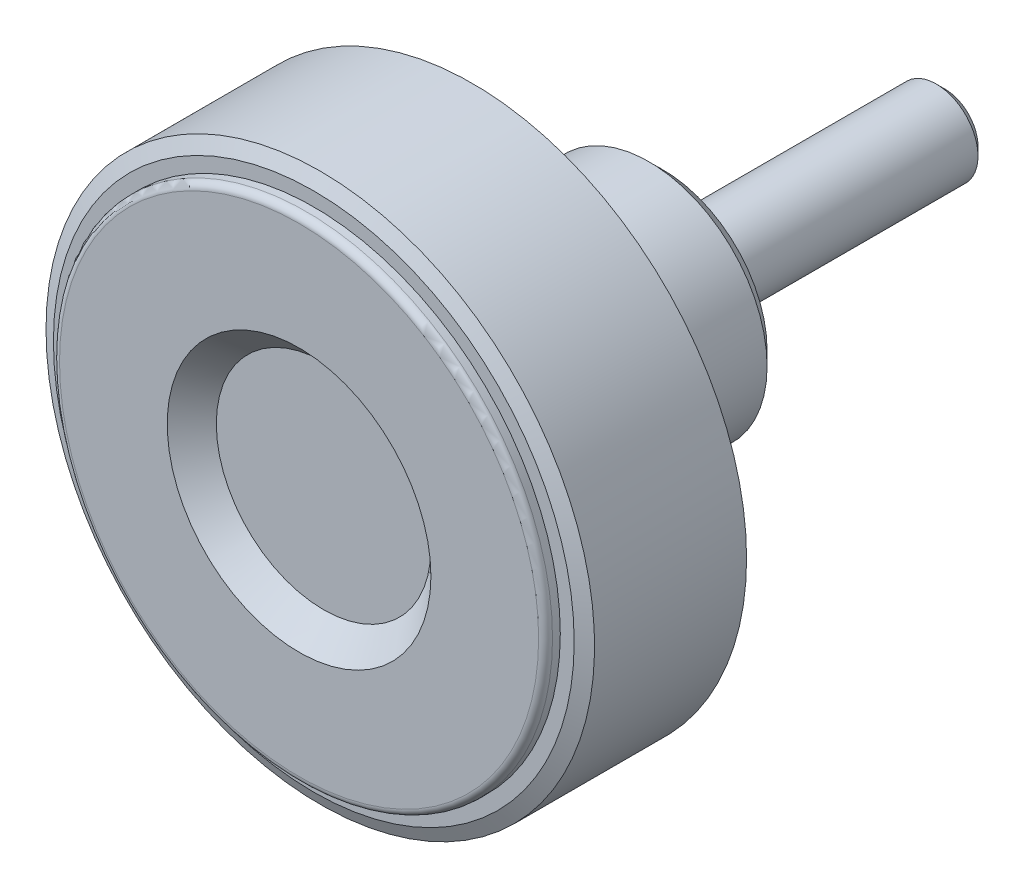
ISO-10303-21;
HEADER;
FILE_DESCRIPTION(('STEP AP214'),'2;1');
FILE_NAME('part.step','',(''),(''),'','','');
FILE_SCHEMA(('AUTOMOTIVE_DESIGN { 1 0 10303 214 1 1 1 1 }'));
ENDSEC;
DATA;
#1=APPLICATION_CONTEXT('core data for automotive mechanical design processes');
#2=APPLICATION_PROTOCOL_DEFINITION('international standard','automotive_design',2000,#1);
#3=PRODUCT_CONTEXT('',#1,'mechanical');
#4=PRODUCT('Part','Part','',(#3));
#5=PRODUCT_RELATED_PRODUCT_CATEGORY('part','',(#4));
#6=PRODUCT_DEFINITION_FORMATION('','',#4);
#7=PRODUCT_DEFINITION_CONTEXT('part definition',#1,'design');
#8=PRODUCT_DEFINITION('design','',#6,#7);
#9=PRODUCT_DEFINITION_SHAPE('','',#8);
#10=(LENGTH_UNIT() NAMED_UNIT(*) SI_UNIT(.MILLI.,.METRE.));
#11=(NAMED_UNIT(*) PLANE_ANGLE_UNIT() SI_UNIT($,.RADIAN.));
#12=(NAMED_UNIT(*) SI_UNIT($,.STERADIAN.) SOLID_ANGLE_UNIT());
#13=UNCERTAINTY_MEASURE_WITH_UNIT(LENGTH_MEASURE(1.E-05),#10,'distance_accuracy_value','');
#14=(GEOMETRIC_REPRESENTATION_CONTEXT(3) GLOBAL_UNCERTAINTY_ASSIGNED_CONTEXT((#13)) GLOBAL_UNIT_ASSIGNED_CONTEXT((#10,
#11,#12)) REPRESENTATION_CONTEXT('',''));
#15=CARTESIAN_POINT('',(0.,0.,0.));
#16=DIRECTION('',(0.,0.,1.));
#17=DIRECTION('',(1.,0.,0.));
#18=AXIS2_PLACEMENT_3D('',#15,#16,#17);
#19=CARTESIAN_POINT('',(0.,1.19325,-20.));
#20=DIRECTION('',(0.,0.,-1.));
#21=DIRECTION('',(-1.,0.,0.));
#22=AXIS2_PLACEMENT_3D('',#19,#20,#21);
#23=PLANE('',#22);
#24=CARTESIAN_POINT('',(0.,0.,-19.9999999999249));
#25=DIRECTION('',(0.,0.,1.));
#26=DIRECTION('',(1.,0.,0.));
#27=AXIS2_PLACEMENT_3D('',#24,#25,#26);
#28=CIRCLE('',#27,2.38650000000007);
#29=CARTESIAN_POINT('',(2.38650000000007,0.,-19.9999999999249));
#30=VERTEX_POINT('',#29);
#31=EDGE_CURVE('E179',#30,#30,#28,.T.);
#32=ORIENTED_EDGE('',*,*,#31,.F.);
#33=EDGE_LOOP('',(#32));
#34=FACE_BOUND('',#33,.T.);
#35=ADVANCED_FACE('F14',(#34),#23,.T.);
#36=CARTESIAN_POINT('',(0.,0.,-19.386499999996));
#37=DIRECTION('',(0.,0.,1.));
#38=DIRECTION('',(1.,0.,0.));
#39=AXIS2_PLACEMENT_3D('',#36,#37,#38);
#40=CONICAL_SURFACE('',#39,2.99999999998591,0.785398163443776);
#41=ORIENTED_EDGE('',*,*,#31,.T.);
#42=EDGE_LOOP('',(#41));
#43=FACE_BOUND('',#42,.T.);
#44=CARTESIAN_POINT('',(0.,0.,-19.3865));
#45=DIRECTION('',(0.,0.,1.));
#46=DIRECTION('',(1.,0.,0.));
#47=AXIS2_PLACEMENT_3D('',#44,#45,#46);
#48=CIRCLE('',#47,3.);
#49=CARTESIAN_POINT('',(3.,0.,-19.3865));
#50=VERTEX_POINT('',#49);
#51=EDGE_CURVE('E176',#50,#50,#48,.T.);
#52=ORIENTED_EDGE('',*,*,#51,.F.);
#53=EDGE_LOOP('',(#52));
#54=FACE_BOUND('',#53,.T.);
#55=ADVANCED_FACE('F536',(#43,#54),#40,.T.);
#56=CARTESIAN_POINT('',(0.,0.,-9.19325));
#57=DIRECTION('',(0.,0.,1.));
#58=DIRECTION('',(1.,0.,0.));
#59=AXIS2_PLACEMENT_3D('',#56,#57,#58);
#60=CYLINDRICAL_SURFACE('',#59,3.);
#61=ORIENTED_EDGE('',*,*,#51,.T.);
#62=EDGE_LOOP('',(#61));
#63=FACE_BOUND('',#62,.T.);
#64=CARTESIAN_POINT('',(0.,0.,0.));
#65=DIRECTION('',(0.,0.,1.));
#66=DIRECTION('',(1.,0.,0.));
#67=AXIS2_PLACEMENT_3D('',#64,#65,#66);
#68=CIRCLE('',#67,3.);
#69=CARTESIAN_POINT('',(3.,0.,0.));
#70=VERTEX_POINT('',#69);
#71=EDGE_CURVE('E178',#70,#70,#68,.T.);
#72=ORIENTED_EDGE('',*,*,#71,.F.);
#73=EDGE_LOOP('',(#72));
#74=FACE_BOUND('',#73,.T.);
#75=ADVANCED_FACE('F526',(#63,#74),#60,.T.);
#76=CARTESIAN_POINT('',(0.,2.,0.));
#77=DIRECTION('',(0.,0.,-1.));
#78=DIRECTION('',(-1.,0.,0.));
#79=AXIS2_PLACEMENT_3D('',#76,#77,#78);
#80=PLANE('',#79);
#81=CARTESIAN_POINT('',(0.,0.,0.));
#82=DIRECTION('',(0.,0.,1.));
#83=DIRECTION('',(1.,0.,0.));
#84=AXIS2_PLACEMENT_3D('',#81,#82,#83);
#85=CIRCLE('',#84,4.);
#86=CARTESIAN_POINT('',(4.,0.,0.));
#87=VERTEX_POINT('',#86);
#88=EDGE_CURVE('E211',#87,#87,#85,.T.);
#89=ORIENTED_EDGE('',*,*,#88,.F.);
#90=EDGE_LOOP('',(#89));
#91=FACE_BOUND('',#90,.T.);
#92=ORIENTED_EDGE('',*,*,#71,.T.);
#93=EDGE_LOOP('',(#92));
#94=FACE_BOUND('',#93,.T.);
#95=ADVANCED_FACE('F516',(#91,#94),#80,.T.);
#96=CARTESIAN_POINT('',(0.,0.,0.15));
#97=DIRECTION('',(0.,0.,1.));
#98=DIRECTION('',(1.,0.,0.));
#99=AXIS2_PLACEMENT_3D('',#96,#97,#98);
#100=CYLINDRICAL_SURFACE('',#99,4.);
#101=ORIENTED_EDGE('',*,*,#88,.T.);
#102=EDGE_LOOP('',(#101));
#103=FACE_BOUND('',#102,.T.);
#104=CARTESIAN_POINT('',(0.,0.,0.3));
#105=DIRECTION('',(0.,0.,1.));
#106=DIRECTION('',(1.,0.,0.));
#107=AXIS2_PLACEMENT_3D('',#104,#105,#106);
#108=CIRCLE('',#107,4.);
#109=CARTESIAN_POINT('',(4.,0.,0.3));
#110=VERTEX_POINT('',#109);
#111=EDGE_CURVE('E208',#110,#110,#108,.T.);
#112=ORIENTED_EDGE('',*,*,#111,.F.);
#113=EDGE_LOOP('',(#112));
#114=FACE_BOUND('',#113,.T.);
#115=ADVANCED_FACE('F506',(#103,#114),#100,.T.);
#116=CARTESIAN_POINT('',(0.,5.75,0.3));
#117=DIRECTION('',(0.,0.,-1.));
#118=DIRECTION('',(-1.,0.,0.));
#119=AXIS2_PLACEMENT_3D('',#116,#117,#118);
#120=PLANE('',#119);
#121=CARTESIAN_POINT('',(0.,0.,0.3));
#122=DIRECTION('',(0.,0.,1.));
#123=DIRECTION('',(1.,0.,0.));
#124=AXIS2_PLACEMENT_3D('',#121,#122,#123);
#125=CIRCLE('',#124,7.5);
#126=CARTESIAN_POINT('',(7.5,0.,0.3));
#127=VERTEX_POINT('',#126);
#128=EDGE_CURVE('E175',#127,#127,#125,.T.);
#129=ORIENTED_EDGE('',*,*,#128,.F.);
#130=EDGE_LOOP('',(#129));
#131=FACE_BOUND('',#130,.T.);
#132=ORIENTED_EDGE('',*,*,#111,.T.);
#133=EDGE_LOOP('',(#132));
#134=FACE_BOUND('',#133,.T.);
#135=ADVANCED_FACE('F496',(#131,#134),#120,.T.);
#136=CARTESIAN_POINT('',(0.,0.,1.3));
#137=DIRECTION('',(0.,0.,1.));
#138=DIRECTION('',(1.,0.,0.));
#139=AXIS2_PLACEMENT_3D('',#136,#137,#138);
#140=CONICAL_SURFACE('',#139,8.5,0.785398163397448);
#141=ORIENTED_EDGE('',*,*,#128,.T.);
#142=EDGE_LOOP('',(#141));
#143=FACE_BOUND('',#142,.T.);
#144=CARTESIAN_POINT('',(0.,0.,1.3));
#145=DIRECTION('',(0.,0.,1.));
#146=DIRECTION('',(1.,0.,0.));
#147=AXIS2_PLACEMENT_3D('',#144,#145,#146);
#148=CIRCLE('',#147,8.5);
#149=CARTESIAN_POINT('',(8.5,0.,1.3));
#150=VERTEX_POINT('',#149);
#151=EDGE_CURVE('E172',#150,#150,#148,.T.);
#152=ORIENTED_EDGE('',*,*,#151,.F.);
#153=EDGE_LOOP('',(#152));
#154=FACE_BOUND('',#153,.T.);
#155=ADVANCED_FACE('F487',(#143,#154),#140,.T.);
#156=CARTESIAN_POINT('',(0.,0.,11.1916666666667));
#157=DIRECTION('',(0.,0.,1.));
#158=DIRECTION('',(1.,0.,0.));
#159=AXIS2_PLACEMENT_3D('',#156,#157,#158);
#160=CYLINDRICAL_SURFACE('',#159,8.5);
#161=ORIENTED_EDGE('',*,*,#151,.T.);
#162=EDGE_LOOP('',(#161));
#163=FACE_BOUND('',#162,.T.);
#164=CARTESIAN_POINT('',(0.,0.,21.0833333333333));
#165=DIRECTION('',(0.,0.,-1.));
#166=DIRECTION('',(-1.,0.,0.));
#167=AXIS2_PLACEMENT_3D('',#164,#165,#166);
#168=CIRCLE('',#167,8.5);
#169=CARTESIAN_POINT('',(-8.5,0.,21.0833333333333));
#170=VERTEX_POINT('',#169);
#171=EDGE_CURVE('E75',#170,#170,#168,.T.);
#172=ORIENTED_EDGE('',*,*,#171,.T.);
#173=EDGE_LOOP('',(#172));
#174=FACE_BOUND('',#173,.T.);
#175=ADVANCED_FACE('F482',(#163,#174),#160,.T.);
#176=CARTESIAN_POINT('',(0.,0.,21.0833333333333));
#177=DIRECTION('',(0.,0.,-1.));
#178=DIRECTION('',(-1.,0.,0.));
#179=AXIS2_PLACEMENT_3D('',#176,#177,#178);
#180=TOROIDAL_SURFACE('',#179,9.5,1.);
#181=CARTESIAN_POINT('',(0.,0.,22.0833333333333));
#182=DIRECTION('',(0.,0.,-1.));
#183=DIRECTION('',(1.,0.,0.));
#184=AXIS2_PLACEMENT_3D('',#181,#182,#183);
#185=CIRCLE('',#184,9.5);
#186=CARTESIAN_POINT('',(-9.5,0.,22.0833333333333));
#187=VERTEX_POINT('',#186);
#188=CARTESIAN_POINT('',(9.5,0.,22.0833333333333));
#189=VERTEX_POINT('',#188);
#190=EDGE_CURVE('E68',#187,#189,#185,.F.);
#191=ORIENTED_EDGE('',*,*,#190,.F.);
#192=CARTESIAN_POINT('',(0.,0.,22.0833333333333));
#193=DIRECTION('',(0.,0.,-1.));
#194=DIRECTION('',(-1.,0.,0.));
#195=AXIS2_PLACEMENT_3D('',#192,#193,#194);
#196=CIRCLE('',#195,9.5);
#197=CARTESIAN_POINT('',(0.,9.5,22.0833333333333));
#198=VERTEX_POINT('',#197);
#199=EDGE_CURVE('E71',#198,#187,#196,.F.);
#200=ORIENTED_EDGE('',*,*,#199,.F.);
#201=CARTESIAN_POINT('',(0.,0.,22.0833333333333));
#202=DIRECTION('',(0.,0.,-1.));
#203=DIRECTION('',(0.,1.,0.));
#204=AXIS2_PLACEMENT_3D('',#201,#202,#203);
#205=CIRCLE('',#204,9.5);
#206=EDGE_CURVE('E63',#189,#198,#205,.F.);
#207=ORIENTED_EDGE('',*,*,#206,.F.);
#208=EDGE_LOOP('',(#191,#200,#207));
#209=FACE_BOUND('',#208,.T.);
#210=ORIENTED_EDGE('',*,*,#171,.F.);
#211=EDGE_LOOP('',(#210));
#212=FACE_BOUND('',#211,.T.);
#213=ADVANCED_FACE('F66',(#209,#212),#180,.F.);
#214=CARTESIAN_POINT('',(0.,11.8461538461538,22.0833333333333));
#215=DIRECTION('',(0.,0.,-1.));
#216=DIRECTION('',(-1.,0.,0.));
#217=AXIS2_PLACEMENT_3D('',#214,#215,#216);
#218=PLANE('',#217);
#219=CARTESIAN_POINT('',(0.,0.,22.0833333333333));
#220=DIRECTION('',(0.,0.,1.));
#221=DIRECTION('',(-1.,0.,0.));
#222=AXIS2_PLACEMENT_3D('',#219,#220,#221);
#223=CIRCLE('',#222,14.1923076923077);
#224=CARTESIAN_POINT('',(14.1923076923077,0.,22.0833333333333));
#225=VERTEX_POINT('',#224);
#226=CARTESIAN_POINT('',(-14.1923076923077,0.,22.0833333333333));
#227=VERTEX_POINT('',#226);
#228=EDGE_CURVE('E81',#225,#227,#223,.F.);
#229=ORIENTED_EDGE('',*,*,#228,.T.);
#230=CARTESIAN_POINT('',(0.,0.,22.0833333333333));
#231=DIRECTION('',(0.,0.,1.));
#232=DIRECTION('',(0.,1.,0.));
#233=AXIS2_PLACEMENT_3D('',#230,#231,#232);
#234=CIRCLE('',#233,14.1923076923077);
#235=CARTESIAN_POINT('',(0.,14.1923076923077,22.0833333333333));
#236=VERTEX_POINT('',#235);
#237=EDGE_CURVE('E130',#227,#236,#234,.F.);
#238=ORIENTED_EDGE('',*,*,#237,.T.);
#239=CARTESIAN_POINT('',(0.,0.,22.0833333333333));
#240=DIRECTION('',(0.,0.,1.));
#241=DIRECTION('',(1.,0.,0.));
#242=AXIS2_PLACEMENT_3D('',#239,#240,#241);
#243=CIRCLE('',#242,14.1923076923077);
#244=EDGE_CURVE('E143',#236,#225,#243,.F.);
#245=ORIENTED_EDGE('',*,*,#244,.T.);
#246=EDGE_LOOP('',(#229,#238,#245));
#247=FACE_BOUND('',#246,.T.);
#248=ORIENTED_EDGE('',*,*,#199,.T.);
#249=ORIENTED_EDGE('',*,*,#190,.T.);
#250=ORIENTED_EDGE('',*,*,#206,.T.);
#251=EDGE_LOOP('',(#248,#249,#250));
#252=FACE_BOUND('',#251,.T.);
#253=ADVANCED_FACE('F79',(#247,#252),#218,.T.);
#254=CARTESIAN_POINT('',(0.,0.,21.0833333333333));
#255=DIRECTION('',(0.,0.,-1.));
#256=DIRECTION('',(-1.,0.,0.));
#257=AXIS2_PLACEMENT_3D('',#254,#255,#256);
#258=TOROIDAL_SURFACE('',#257,14.1923076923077,1.);
#259=ORIENTED_EDGE('',*,*,#237,.F.);
#260=ORIENTED_EDGE('',*,*,#228,.F.);
#261=ORIENTED_EDGE('',*,*,#244,.F.);
#262=EDGE_LOOP('',(#259,#260,#261));
#263=FACE_BOUND('',#262,.T.);
#264=CARTESIAN_POINT('',(0.,0.,21.0833333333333));
#265=DIRECTION('',(0.,0.,1.));
#266=DIRECTION('',(1.,0.,0.));
#267=AXIS2_PLACEMENT_3D('',#264,#265,#266);
#268=CIRCLE('',#267,15.1923076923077);
#269=CARTESIAN_POINT('',(15.1923076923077,0.,21.0833333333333));
#270=VERTEX_POINT('',#269);
#271=EDGE_CURVE('E205',#270,#270,#268,.F.);
#272=ORIENTED_EDGE('',*,*,#271,.T.);
#273=EDGE_LOOP('',(#272));
#274=FACE_BOUND('',#273,.T.);
#275=ADVANCED_FACE('F100',(#263,#274),#258,.F.);
#276=CARTESIAN_POINT('',(0.,0.,16.7916666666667));
#277=DIRECTION('',(0.,0.,1.));
#278=DIRECTION('',(1.,0.,0.));
#279=AXIS2_PLACEMENT_3D('',#276,#277,#278);
#280=CYLINDRICAL_SURFACE('',#279,15.1923076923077);
#281=ORIENTED_EDGE('',*,*,#271,.F.);
#282=EDGE_LOOP('',(#281));
#283=FACE_BOUND('',#282,.T.);
#284=CARTESIAN_POINT('',(0.,0.,12.5));
#285=DIRECTION('',(0.,0.,1.));
#286=DIRECTION('',(1.,0.,0.));
#287=AXIS2_PLACEMENT_3D('',#284,#285,#286);
#288=CIRCLE('',#287,15.1923076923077);
#289=CARTESIAN_POINT('',(15.1923076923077,0.,12.5));
#290=VERTEX_POINT('',#289);
#291=EDGE_CURVE('E201',#290,#290,#288,.T.);
#292=ORIENTED_EDGE('',*,*,#291,.F.);
#293=EDGE_LOOP('',(#292));
#294=FACE_BOUND('',#293,.T.);
#295=ADVANCED_FACE('F329',(#283,#294),#280,.F.);
#296=CARTESIAN_POINT('',(0.,16.2211538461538,12.5));
#297=DIRECTION('',(0.,0.,-1.));
#298=DIRECTION('',(-1.,0.,0.));
#299=AXIS2_PLACEMENT_3D('',#296,#297,#298);
#300=PLANE('',#299);
#301=CARTESIAN_POINT('',(0.,0.,12.5));
#302=DIRECTION('',(0.,0.,1.));
#303=DIRECTION('',(-1.,0.,0.));
#304=AXIS2_PLACEMENT_3D('',#301,#302,#303);
#305=CIRCLE('',#304,17.25);
#306=CARTESIAN_POINT('',(-17.25,0.,12.5));
#307=VERTEX_POINT('',#306);
#308=CARTESIAN_POINT('',(17.25,0.,12.5));
#309=VERTEX_POINT('',#308);
#310=EDGE_CURVE('E264',#307,#309,#305,.T.);
#311=ORIENTED_EDGE('',*,*,#310,.F.);
#312=CARTESIAN_POINT('',(0.,0.,12.5));
#313=DIRECTION('',(0.,0.,1.));
#314=DIRECTION('',(0.,1.,0.));
#315=AXIS2_PLACEMENT_3D('',#312,#313,#314);
#316=CIRCLE('',#315,17.25);
#317=CARTESIAN_POINT('',(0.,17.25,12.5));
#318=VERTEX_POINT('',#317);
#319=EDGE_CURVE('E299',#318,#307,#316,.T.);
#320=ORIENTED_EDGE('',*,*,#319,.F.);
#321=CARTESIAN_POINT('',(0.,0.,12.5));
#322=DIRECTION('',(0.,0.,1.));
#323=DIRECTION('',(1.,0.,0.));
#324=AXIS2_PLACEMENT_3D('',#321,#322,#323);
#325=CIRCLE('',#324,17.25);
#326=EDGE_CURVE('E204',#309,#318,#325,.T.);
#327=ORIENTED_EDGE('',*,*,#326,.F.);
#328=EDGE_LOOP('',(#311,#320,#327));
#329=FACE_BOUND('',#328,.T.);
#330=ORIENTED_EDGE('',*,*,#291,.T.);
#331=EDGE_LOOP('',(#330));
#332=FACE_BOUND('',#331,.T.);
#333=ADVANCED_FACE('F275',(#329,#332),#300,.T.);
#334=CARTESIAN_POINT('',(0.,0.,13.));
#335=DIRECTION('',(0.,0.,-1.));
#336=DIRECTION('',(-1.,0.,0.));
#337=AXIS2_PLACEMENT_3D('',#334,#335,#336);
#338=TOROIDAL_SURFACE('',#337,17.25,0.5);
#339=ORIENTED_EDGE('',*,*,#319,.T.);
#340=ORIENTED_EDGE('',*,*,#310,.T.);
#341=ORIENTED_EDGE('',*,*,#326,.T.);
#342=EDGE_LOOP('',(#339,#340,#341));
#343=FACE_BOUND('',#342,.T.);
#344=CARTESIAN_POINT('',(0.,0.,13.));
#345=DIRECTION('',(0.,0.,1.));
#346=DIRECTION('',(1.,0.,0.));
#347=AXIS2_PLACEMENT_3D('',#344,#345,#346);
#348=CIRCLE('',#347,17.75);
#349=CARTESIAN_POINT('',(17.75,0.,13.));
#350=VERTEX_POINT('',#349);
#351=EDGE_CURVE('E200',#350,#350,#348,.T.);
#352=ORIENTED_EDGE('',*,*,#351,.F.);
#353=EDGE_LOOP('',(#352));
#354=FACE_BOUND('',#353,.T.);
#355=ADVANCED_FACE('F269',(#343,#354),#338,.T.);
#356=CARTESIAN_POINT('',(0.,0.,13.28));
#357=DIRECTION('',(0.,0.,1.));
#358=DIRECTION('',(1.,0.,0.));
#359=AXIS2_PLACEMENT_3D('',#356,#357,#358);
#360=CYLINDRICAL_SURFACE('',#359,17.75);
#361=ORIENTED_EDGE('',*,*,#351,.T.);
#362=EDGE_LOOP('',(#361));
#363=FACE_BOUND('',#362,.T.);
#364=CARTESIAN_POINT('',(0.,0.,13.56));
#365=DIRECTION('',(0.,0.,1.));
#366=DIRECTION('',(1.,0.,0.));
#367=AXIS2_PLACEMENT_3D('',#364,#365,#366);
#368=CIRCLE('',#367,17.75);
#369=CARTESIAN_POINT('',(17.75,0.,13.56));
#370=VERTEX_POINT('',#369);
#371=EDGE_CURVE('E197',#370,#370,#368,.T.);
#372=ORIENTED_EDGE('',*,*,#371,.F.);
#373=EDGE_LOOP('',(#372));
#374=FACE_BOUND('',#373,.T.);
#375=ADVANCED_FACE('F274',(#363,#374),#360,.T.);
#376=CARTESIAN_POINT('',(0.,18.25,13.56));
#377=DIRECTION('',(0.,0.,-1.));
#378=DIRECTION('',(-1.,0.,0.));
#379=AXIS2_PLACEMENT_3D('',#376,#377,#378);
#380=PLANE('',#379);
#381=CARTESIAN_POINT('',(0.,0.,13.56));
#382=DIRECTION('',(0.,0.,1.));
#383=DIRECTION('',(1.,0.,0.));
#384=AXIS2_PLACEMENT_3D('',#381,#382,#383);
#385=CIRCLE('',#384,18.75);
#386=CARTESIAN_POINT('',(18.75,0.,13.56));
#387=VERTEX_POINT('',#386);
#388=EDGE_CURVE('E193',#387,#387,#385,.T.);
#389=ORIENTED_EDGE('',*,*,#388,.F.);
#390=EDGE_LOOP('',(#389));
#391=FACE_BOUND('',#390,.T.);
#392=ORIENTED_EDGE('',*,*,#371,.T.);
#393=EDGE_LOOP('',(#392));
#394=FACE_BOUND('',#393,.T.);
#395=ADVANCED_FACE('F342',(#391,#394),#380,.T.);
#396=CARTESIAN_POINT('',(0.,0.,14.026307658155));
#397=DIRECTION('',(0.,0.,1.));
#398=DIRECTION('',(1.,0.,0.));
#399=AXIS2_PLACEMENT_3D('',#396,#397,#398);
#400=CONICAL_SURFACE('',#399,19.75,1.13446401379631);
#401=CARTESIAN_POINT('',(-1.50102152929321E-13,-1.52766688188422E-12,14.026307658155));
#402=DIRECTION('',(0.,0.,-1.));
#403=DIRECTION('',(-1.,0.,0.));
#404=AXIS2_PLACEMENT_3D('',#401,#402,#403);
#405=CIRCLE('',#404,19.7500000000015);
#406=CARTESIAN_POINT('',(-19.7500000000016,-1.52766688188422E-12,14.026307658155));
#407=VERTEX_POINT('',#406);
#408=EDGE_CURVE('E196',#407,#407,#405,.F.);
#409=ORIENTED_EDGE('',*,*,#408,.F.);
#410=EDGE_LOOP('',(#409));
#411=FACE_BOUND('',#410,.T.);
#412=ORIENTED_EDGE('',*,*,#388,.T.);
#413=EDGE_LOOP('',(#412));
#414=FACE_BOUND('',#413,.T.);
#415=ADVANCED_FACE('F340',(#411,#414),#400,.T.);
#416=CARTESIAN_POINT('',(0.,3.86363636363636,24.7333333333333));
#417=DIRECTION('',(0.,0.,1.));
#418=DIRECTION('',(1.,0.,0.));
#419=AXIS2_PLACEMENT_3D('',#416,#417,#418);
#420=PLANE('',#419);
#421=CARTESIAN_POINT('',(0.,0.,24.7333333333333));
#422=DIRECTION('',(0.,0.,1.));
#423=DIRECTION('',(1.,0.,0.));
#424=AXIS2_PLACEMENT_3D('',#421,#422,#423);
#425=CIRCLE('',#424,7.7272727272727);
#426=CARTESIAN_POINT('',(7.7272727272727,0.,24.7333333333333));
#427=VERTEX_POINT('',#426);
#428=EDGE_CURVE('E181',#427,#427,#425,.T.);
#429=ORIENTED_EDGE('',*,*,#428,.T.);
#430=EDGE_LOOP('',(#429));
#431=FACE_BOUND('',#430,.T.);
#432=ADVANCED_FACE('F242',(#431),#420,.T.);
#433=CARTESIAN_POINT('',(0.,0.,26.5));
#434=DIRECTION('',(0.,0.,1.));
#435=DIRECTION('',(1.,0.,0.));
#436=AXIS2_PLACEMENT_3D('',#433,#434,#435);
#437=CONICAL_SURFACE('',#436,9.49393939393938,0.785398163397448);
#438=CARTESIAN_POINT('',(0.,0.,26.5));
#439=DIRECTION('',(0.,0.,1.));
#440=DIRECTION('',(1.,0.,0.));
#441=AXIS2_PLACEMENT_3D('',#438,#439,#440);
#442=CIRCLE('',#441,9.49393939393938);
#443=CARTESIAN_POINT('',(9.49393939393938,0.,26.5));
#444=VERTEX_POINT('',#443);
#445=EDGE_CURVE('E9',#444,#444,#442,.F.);
#446=ORIENTED_EDGE('',*,*,#445,.F.);
#447=EDGE_LOOP('',(#446));
#448=FACE_BOUND('',#447,.T.);
#449=ORIENTED_EDGE('',*,*,#428,.F.);
#450=EDGE_LOOP('',(#449));
#451=FACE_BOUND('',#450,.T.);
#452=ADVANCED_FACE('F240',(#448,#451),#437,.F.);
#453=CARTESIAN_POINT('',(0.,13.3719696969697,26.5));
#454=DIRECTION('',(0.,0.,1.));
#455=DIRECTION('',(1.,0.,0.));
#456=AXIS2_PLACEMENT_3D('',#453,#454,#455);
#457=PLANE('',#456);
#458=ORIENTED_EDGE('',*,*,#445,.T.);
#459=EDGE_LOOP('',(#458));
#460=FACE_BOUND('',#459,.T.);
#461=CARTESIAN_POINT('',(0.,0.,26.5));
#462=DIRECTION('',(0.,0.,-1.));
#463=DIRECTION('',(-1.,0.,0.));
#464=AXIS2_PLACEMENT_3D('',#461,#462,#463);
#465=CIRCLE('',#464,17.25);
#466=CARTESIAN_POINT('',(0.,17.25,26.5));
#467=VERTEX_POINT('',#466);
#468=CARTESIAN_POINT('',(-17.25,0.,26.5));
#469=VERTEX_POINT('',#468);
#470=EDGE_CURVE('E219',#467,#469,#465,.F.);
#471=ORIENTED_EDGE('',*,*,#470,.T.);
#472=CARTESIAN_POINT('',(0.,0.,26.5));
#473=DIRECTION('',(0.,0.,-1.));
#474=DIRECTION('',(1.,0.,0.));
#475=AXIS2_PLACEMENT_3D('',#472,#473,#474);
#476=CIRCLE('',#475,17.25);
#477=CARTESIAN_POINT('',(17.25,0.,26.5));
#478=VERTEX_POINT('',#477);
#479=EDGE_CURVE('E23',#469,#478,#476,.F.);
#480=ORIENTED_EDGE('',*,*,#479,.T.);
#481=CARTESIAN_POINT('',(0.,0.,26.5));
#482=DIRECTION('',(0.,0.,-1.));
#483=DIRECTION('',(0.,1.,0.));
#484=AXIS2_PLACEMENT_3D('',#481,#482,#483);
#485=CIRCLE('',#484,17.25);
#486=EDGE_CURVE('E184',#478,#467,#485,.F.);
#487=ORIENTED_EDGE('',*,*,#486,.T.);
#488=EDGE_LOOP('',(#471,#480,#487));
#489=FACE_BOUND('',#488,.T.);
#490=ADVANCED_FACE('F238',(#460,#489),#457,.T.);
#491=CARTESIAN_POINT('',(0.,0.,26.));
#492=DIRECTION('',(0.,0.,-1.));
#493=DIRECTION('',(-1.,0.,0.));
#494=AXIS2_PLACEMENT_3D('',#491,#492,#493);
#495=TOROIDAL_SURFACE('',#494,17.25,0.5);
#496=CARTESIAN_POINT('',(0.,0.,26.));
#497=DIRECTION('',(0.,0.,-1.));
#498=DIRECTION('',(-1.,0.,0.));
#499=AXIS2_PLACEMENT_3D('',#496,#497,#498);
#500=CIRCLE('',#499,17.75);
#501=CARTESIAN_POINT('',(-17.75,0.,26.));
#502=VERTEX_POINT('',#501);
#503=EDGE_CURVE('E185',#502,#502,#500,.F.);
#504=ORIENTED_EDGE('',*,*,#503,.T.);
#505=EDGE_LOOP('',(#504));
#506=FACE_BOUND('',#505,.T.);
#507=ORIENTED_EDGE('',*,*,#479,.F.);
#508=ORIENTED_EDGE('',*,*,#470,.F.);
#509=ORIENTED_EDGE('',*,*,#486,.F.);
#510=EDGE_LOOP('',(#507,#508,#509));
#511=FACE_BOUND('',#510,.T.);
#512=ADVANCED_FACE('F226',(#506,#511),#495,.T.);
#513=CARTESIAN_POINT('',(0.,0.,25.72));
#514=DIRECTION('',(0.,0.,1.));
#515=DIRECTION('',(1.,0.,0.));
#516=AXIS2_PLACEMENT_3D('',#513,#514,#515);
#517=CYLINDRICAL_SURFACE('',#516,17.75);
#518=ORIENTED_EDGE('',*,*,#503,.F.);
#519=EDGE_LOOP('',(#518));
#520=FACE_BOUND('',#519,.T.);
#521=CARTESIAN_POINT('',(0.,0.,25.44));
#522=DIRECTION('',(0.,0.,1.));
#523=DIRECTION('',(1.,0.,0.));
#524=AXIS2_PLACEMENT_3D('',#521,#522,#523);
#525=CIRCLE('',#524,17.75);
#526=CARTESIAN_POINT('',(17.75,0.,25.44));
#527=VERTEX_POINT('',#526);
#528=EDGE_CURVE('E186',#527,#527,#525,.T.);
#529=ORIENTED_EDGE('',*,*,#528,.T.);
#530=EDGE_LOOP('',(#529));
#531=FACE_BOUND('',#530,.T.);
#532=ADVANCED_FACE('F237',(#520,#531),#517,.T.);
#533=CARTESIAN_POINT('',(0.,0.,24.973692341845));
#534=DIRECTION('',(0.,0.,-1.));
#535=DIRECTION('',(-1.,0.,0.));
#536=AXIS2_PLACEMENT_3D('',#533,#534,#535);
#537=CONICAL_SURFACE('',#536,19.75,1.13446401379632);
#538=CARTESIAN_POINT('',(0.,0.,25.44));
#539=DIRECTION('',(0.,0.,-1.));
#540=DIRECTION('',(-1.,0.,0.));
#541=AXIS2_PLACEMENT_3D('',#538,#539,#540);
#542=CIRCLE('',#541,18.75);
#543=CARTESIAN_POINT('',(-18.75,0.,25.44));
#544=VERTEX_POINT('',#543);
#545=EDGE_CURVE('E189',#544,#544,#542,.F.);
#546=ORIENTED_EDGE('',*,*,#545,.F.);
#547=EDGE_LOOP('',(#546));
#548=FACE_BOUND('',#547,.T.);
#549=CARTESIAN_POINT('',(0.,0.,24.973692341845));
#550=DIRECTION('',(0.,0.,-1.));
#551=DIRECTION('',(0.,1.,0.));
#552=AXIS2_PLACEMENT_3D('',#549,#550,#551);
#553=CIRCLE('',#552,19.75);
#554=CARTESIAN_POINT('',(0.,19.75,24.973692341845));
#555=VERTEX_POINT('',#554);
#556=EDGE_CURVE('E192',#555,#555,#553,.F.);
#557=ORIENTED_EDGE('',*,*,#556,.T.);
#558=EDGE_LOOP('',(#557));
#559=FACE_BOUND('',#558,.T.);
#560=ADVANCED_FACE('F360',(#548,#559),#537,.T.);
#561=CARTESIAN_POINT('',(0.,18.25,25.44));
#562=DIRECTION('',(0.,0.,1.));
#563=DIRECTION('',(1.,0.,0.));
#564=AXIS2_PLACEMENT_3D('',#561,#562,#563);
#565=PLANE('',#564);
#566=ORIENTED_EDGE('',*,*,#528,.F.);
#567=EDGE_LOOP('',(#566));
#568=FACE_BOUND('',#567,.T.);
#569=ORIENTED_EDGE('',*,*,#545,.T.);
#570=EDGE_LOOP('',(#569));
#571=FACE_BOUND('',#570,.T.);
#572=ADVANCED_FACE('F358',(#568,#571),#565,.T.);
#573=CARTESIAN_POINT('',(-1.50102152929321E-13,-1.52766688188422E-12,0.));
#574=DIRECTION('',(0.,0.,-1.));
#575=DIRECTION('',(-1.,0.,0.));
#576=AXIS2_PLACEMENT_3D('',#573,#574,#575);
#577=CYLINDRICAL_SURFACE('',#576,19.7500000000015);
#578=ORIENTED_EDGE('',*,*,#408,.T.);
#579=EDGE_LOOP('',(#578));
#580=FACE_BOUND('',#579,.T.);
#581=ORIENTED_EDGE('',*,*,#556,.F.);
#582=EDGE_LOOP('',(#581));
#583=FACE_BOUND('',#582,.T.);
#584=ADVANCED_FACE('F355',(#580,#583),#577,.T.);
#585=CLOSED_SHELL('',(#35,#55,#75,#95,#115,#135,#155,#175,#213,#253,#275,#295,#333,#355,#375,
#395,#415,#432,#452,#490,#512,#532,#560,#572,#584));
#586=MANIFOLD_SOLID_BREP('B1',#585);
#587=ADVANCED_BREP_SHAPE_REPRESENTATION('',(#18,#586),#14);
#588=SHAPE_DEFINITION_REPRESENTATION(#9,#587);
ENDSEC;
END-ISO-10303-21;
